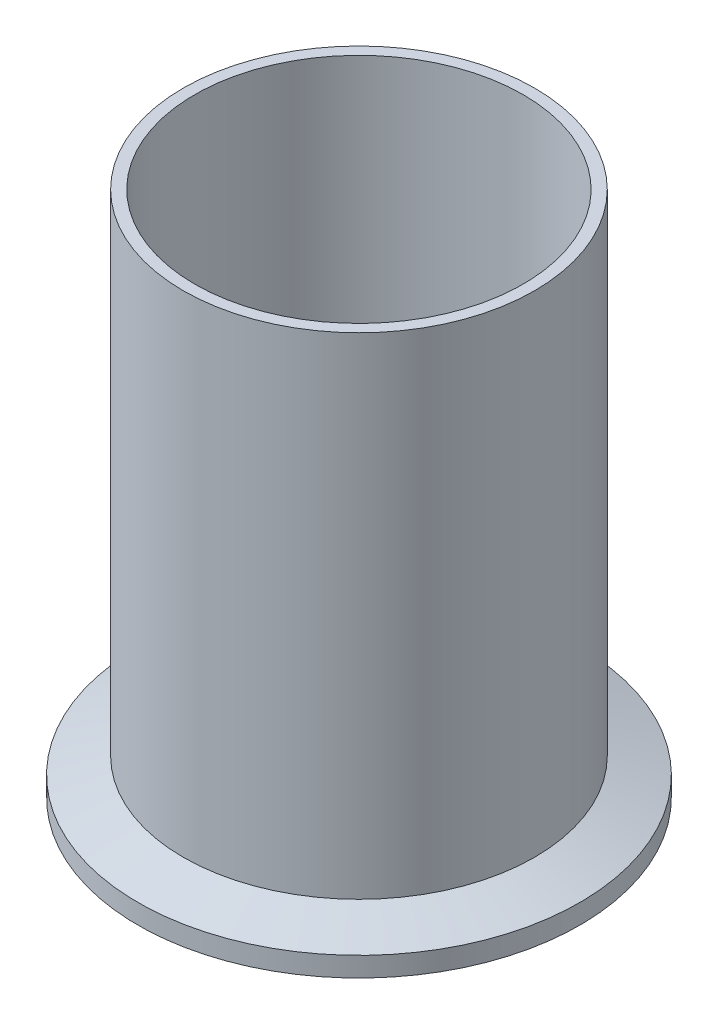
ISO-10303-21;
HEADER;
FILE_DESCRIPTION(('STEP AP214'),'2;1');
FILE_NAME('part.step','',(''),(''),'','','');
FILE_SCHEMA(('AUTOMOTIVE_DESIGN { 1 0 10303 214 1 1 1 1 }'));
ENDSEC;
DATA;
#1=APPLICATION_CONTEXT('core data for automotive mechanical design processes');
#2=APPLICATION_PROTOCOL_DEFINITION('international standard','automotive_design',2000,#1);
#3=PRODUCT_CONTEXT('',#1,'mechanical');
#4=PRODUCT('Part','Part','',(#3));
#5=PRODUCT_RELATED_PRODUCT_CATEGORY('part','',(#4));
#6=PRODUCT_DEFINITION_FORMATION('','',#4);
#7=PRODUCT_DEFINITION_CONTEXT('part definition',#1,'design');
#8=PRODUCT_DEFINITION('design','',#6,#7);
#9=PRODUCT_DEFINITION_SHAPE('','',#8);
#10=(LENGTH_UNIT() NAMED_UNIT(*) SI_UNIT(.MILLI.,.METRE.));
#11=(NAMED_UNIT(*) PLANE_ANGLE_UNIT() SI_UNIT($,.RADIAN.));
#12=(NAMED_UNIT(*) SI_UNIT($,.STERADIAN.) SOLID_ANGLE_UNIT());
#13=UNCERTAINTY_MEASURE_WITH_UNIT(LENGTH_MEASURE(1.E-05),#10,'distance_accuracy_value','');
#14=(GEOMETRIC_REPRESENTATION_CONTEXT(3) GLOBAL_UNCERTAINTY_ASSIGNED_CONTEXT((#13)) GLOBAL_UNIT_ASSIGNED_CONTEXT((#10,
#11,#12)) REPRESENTATION_CONTEXT('',''));
#15=CARTESIAN_POINT('',(0.,0.,0.));
#16=DIRECTION('',(0.,0.,1.));
#17=DIRECTION('',(1.,0.,0.));
#18=AXIS2_PLACEMENT_3D('',#15,#16,#17);
#19=CARTESIAN_POINT('',(0.,0.7874,0.));
#20=DIRECTION('',(0.,-1.,0.));
#21=DIRECTION('',(0.,0.,-1.));
#22=AXIS2_PLACEMENT_3D('',#19,#20,#21);
#23=TOROIDAL_SURFACE('',#22,29.9866084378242,0.787399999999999);
#24=CARTESIAN_POINT('',(0.,0.,0.));
#25=DIRECTION('',(0.,-1.,0.));
#26=DIRECTION('',(0.,0.,-1.));
#27=AXIS2_PLACEMENT_3D('',#24,#25,#26);
#28=CIRCLE('',#27,29.9866084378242);
#29=CARTESIAN_POINT('',(0.,0.,-29.9866084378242));
#30=VERTEX_POINT('',#29);
#31=EDGE_CURVE('E67',#30,#30,#28,.T.);
#32=ORIENTED_EDGE('',*,*,#31,.T.);
#33=EDGE_LOOP('',(#32));
#34=FACE_BOUND('',#33,.T.);
#35=CARTESIAN_POINT('',(0.,0.474458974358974,0.));
#36=DIRECTION('',(0.,-1.,0.));
#37=DIRECTION('',(0.,0.,-1.));
#38=AXIS2_PLACEMENT_3D('',#35,#36,#37);
#39=CIRCLE('',#38,29.2640666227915);
#40=CARTESIAN_POINT('',(0.,0.474458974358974,-29.2640666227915));
#41=VERTEX_POINT('',#40);
#42=EDGE_CURVE('E10',#41,#41,#39,.T.);
#43=ORIENTED_EDGE('',*,*,#42,.F.);
#44=EDGE_LOOP('',(#43));
#45=FACE_BOUND('',#44,.T.);
#46=ADVANCED_FACE('F33',(#34,#45),#23,.T.);
#47=CARTESIAN_POINT('',(0.,0.,0.));
#48=DIRECTION('',(0.,-1.,0.));
#49=DIRECTION('',(0.,0.,-1.));
#50=AXIS2_PLACEMENT_3D('',#47,#48,#49);
#51=TOROIDAL_SURFACE('',#50,28.1686,1.1938);
#52=CARTESIAN_POINT('',(0.,0.474458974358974,0.));
#53=DIRECTION('',(0.,-1.,0.));
#54=DIRECTION('',(0.,0.,-1.));
#55=AXIS2_PLACEMENT_3D('',#52,#53,#54);
#56=CIRCLE('',#55,27.0731333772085);
#57=CARTESIAN_POINT('',(0.,0.474458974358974,-27.0731333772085));
#58=VERTEX_POINT('',#57);
#59=EDGE_CURVE('E39',#58,#58,#56,.T.);
#60=ORIENTED_EDGE('',*,*,#59,.F.);
#61=EDGE_LOOP('',(#60));
#62=FACE_BOUND('',#61,.T.);
#63=ORIENTED_EDGE('',*,*,#42,.T.);
#64=EDGE_LOOP('',(#63));
#65=FACE_BOUND('',#64,.T.);
#66=ADVANCED_FACE('F115',(#62,#65),#51,.F.);
#67=CARTESIAN_POINT('',(0.,0.7874,0.));
#68=DIRECTION('',(0.,-1.,0.));
#69=DIRECTION('',(0.,0.,-1.));
#70=AXIS2_PLACEMENT_3D('',#67,#68,#69);
#71=TOROIDAL_SURFACE('',#70,26.3505915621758,0.787399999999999);
#72=ORIENTED_EDGE('',*,*,#59,.T.);
#73=EDGE_LOOP('',(#72));
#74=FACE_BOUND('',#73,.T.);
#75=CARTESIAN_POINT('',(0.,0.,0.));
#76=DIRECTION('',(0.,-1.,0.));
#77=DIRECTION('',(0.,0.,-1.));
#78=AXIS2_PLACEMENT_3D('',#75,#76,#77);
#79=CIRCLE('',#78,26.3505915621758);
#80=CARTESIAN_POINT('',(0.,0.,-26.3505915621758));
#81=VERTEX_POINT('',#80);
#82=EDGE_CURVE('E43',#81,#81,#79,.T.);
#83=ORIENTED_EDGE('',*,*,#82,.F.);
#84=EDGE_LOOP('',(#83));
#85=FACE_BOUND('',#84,.T.);
#86=ADVANCED_FACE('F111',(#74,#85),#71,.T.);
#87=CARTESIAN_POINT('',(0.,0.,0.));
#88=DIRECTION('',(0.,1.,0.));
#89=DIRECTION('',(0.,0.,1.));
#90=AXIS2_PLACEMENT_3D('',#87,#88,#89);
#91=PLANE('',#90);
#92=CARTESIAN_POINT('',(0.,0.,0.));
#93=DIRECTION('',(0.,-1.,0.));
#94=DIRECTION('',(0.,0.,-1.));
#95=AXIS2_PLACEMENT_3D('',#92,#93,#94);
#96=CIRCLE('',#95,23.749);
#97=CARTESIAN_POINT('',(0.,0.,-23.749));
#98=VERTEX_POINT('',#97);
#99=EDGE_CURVE('E47',#98,#98,#96,.T.);
#100=ORIENTED_EDGE('',*,*,#99,.F.);
#101=EDGE_LOOP('',(#100));
#102=FACE_BOUND('',#101,.T.);
#103=ORIENTED_EDGE('',*,*,#82,.T.);
#104=EDGE_LOOP('',(#103));
#105=FACE_BOUND('',#104,.T.);
#106=ADVANCED_FACE('F105',(#102,#105),#91,.F.);
#107=CARTESIAN_POINT('',(0.,0.,0.));
#108=DIRECTION('',(0.,-1.,0.));
#109=DIRECTION('',(0.,0.,-1.));
#110=AXIS2_PLACEMENT_3D('',#107,#108,#109);
#111=CYLINDRICAL_SURFACE('',#110,23.749);
#112=ORIENTED_EDGE('',*,*,#99,.T.);
#113=EDGE_LOOP('',(#112));
#114=FACE_BOUND('',#113,.T.);
#115=CARTESIAN_POINT('',(0.,76.2,0.));
#116=DIRECTION('',(0.,-1.,0.));
#117=DIRECTION('',(0.,0.,-1.));
#118=AXIS2_PLACEMENT_3D('',#115,#116,#117);
#119=CIRCLE('',#118,23.749);
#120=CARTESIAN_POINT('',(0.,76.2,-23.749));
#121=VERTEX_POINT('',#120);
#122=EDGE_CURVE('E52',#121,#121,#119,.T.);
#123=ORIENTED_EDGE('',*,*,#122,.F.);
#124=EDGE_LOOP('',(#123));
#125=FACE_BOUND('',#124,.T.);
#126=ADVANCED_FACE('F100',(#114,#125),#111,.F.);
#127=CARTESIAN_POINT('',(0.,76.2,0.));
#128=DIRECTION('',(0.,-1.,0.));
#129=DIRECTION('',(0.,0.,-1.));
#130=AXIS2_PLACEMENT_3D('',#127,#128,#129);
#131=PLANE('',#130);
#132=CARTESIAN_POINT('',(0.,76.2,0.));
#133=DIRECTION('',(0.,-1.,0.));
#134=DIRECTION('',(0.,0.,-1.));
#135=AXIS2_PLACEMENT_3D('',#132,#133,#134);
#136=CIRCLE('',#135,25.4);
#137=CARTESIAN_POINT('',(0.,76.2,-25.4));
#138=VERTEX_POINT('',#137);
#139=EDGE_CURVE('E55',#138,#138,#136,.T.);
#140=ORIENTED_EDGE('',*,*,#139,.F.);
#141=EDGE_LOOP('',(#140));
#142=FACE_BOUND('',#141,.T.);
#143=ORIENTED_EDGE('',*,*,#122,.T.);
#144=EDGE_LOOP('',(#143));
#145=FACE_BOUND('',#144,.T.);
#146=ADVANCED_FACE('F94',(#142,#145),#131,.F.);
#147=CARTESIAN_POINT('',(0.,0.,0.));
#148=DIRECTION('',(0.,-1.,0.));
#149=DIRECTION('',(0.,0.,-1.));
#150=AXIS2_PLACEMENT_3D('',#147,#148,#149);
#151=CYLINDRICAL_SURFACE('',#150,25.4);
#152=CARTESIAN_POINT('',(0.,5.22996973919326,0.));
#153=DIRECTION('',(0.,-1.,0.));
#154=DIRECTION('',(0.,0.,-1.));
#155=AXIS2_PLACEMENT_3D('',#152,#153,#154);
#156=CIRCLE('',#155,25.4);
#157=CARTESIAN_POINT('',(0.,5.22996973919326,-25.4));
#158=VERTEX_POINT('',#157);
#159=EDGE_CURVE('E58',#158,#158,#156,.T.);
#160=ORIENTED_EDGE('',*,*,#159,.F.);
#161=EDGE_LOOP('',(#160));
#162=FACE_BOUND('',#161,.T.);
#163=ORIENTED_EDGE('',*,*,#139,.T.);
#164=EDGE_LOOP('',(#163));
#165=FACE_BOUND('',#164,.T.);
#166=ADVANCED_FACE('F88',(#162,#165),#151,.T.);
#167=CARTESIAN_POINT('',(0.,5.22996973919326,0.));
#168=DIRECTION('',(0.,-1.,0.));
#169=DIRECTION('',(0.,0.,-1.));
#170=AXIS2_PLACEMENT_3D('',#167,#168,#169);
#171=CONICAL_SURFACE('',#170,25.4,1.22173047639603);
#172=CARTESIAN_POINT('',(0.,2.8448,0.));
#173=DIRECTION('',(0.,-1.,0.));
#174=DIRECTION('',(0.,0.,-1.));
#175=AXIS2_PLACEMENT_3D('',#172,#173,#174);
#176=CIRCLE('',#175,31.9532);
#177=CARTESIAN_POINT('',(0.,2.8448,-31.9532));
#178=VERTEX_POINT('',#177);
#179=EDGE_CURVE('E61',#178,#178,#176,.T.);
#180=ORIENTED_EDGE('',*,*,#179,.F.);
#181=EDGE_LOOP('',(#180));
#182=FACE_BOUND('',#181,.T.);
#183=ORIENTED_EDGE('',*,*,#159,.T.);
#184=EDGE_LOOP('',(#183));
#185=FACE_BOUND('',#184,.T.);
#186=ADVANCED_FACE('F82',(#182,#185),#171,.T.);
#187=CARTESIAN_POINT('',(0.,0.,0.));
#188=DIRECTION('',(0.,-1.,0.));
#189=DIRECTION('',(0.,0.,-1.));
#190=AXIS2_PLACEMENT_3D('',#187,#188,#189);
#191=CYLINDRICAL_SURFACE('',#190,31.9532);
#192=CARTESIAN_POINT('',(0.,0.,0.));
#193=DIRECTION('',(0.,-1.,0.));
#194=DIRECTION('',(0.,0.,-1.));
#195=AXIS2_PLACEMENT_3D('',#192,#193,#194);
#196=CIRCLE('',#195,31.9532);
#197=CARTESIAN_POINT('',(0.,0.,-31.9532));
#198=VERTEX_POINT('',#197);
#199=EDGE_CURVE('E64',#198,#198,#196,.T.);
#200=ORIENTED_EDGE('',*,*,#199,.F.);
#201=EDGE_LOOP('',(#200));
#202=FACE_BOUND('',#201,.T.);
#203=ORIENTED_EDGE('',*,*,#179,.T.);
#204=EDGE_LOOP('',(#203));
#205=FACE_BOUND('',#204,.T.);
#206=ADVANCED_FACE('F76',(#202,#205),#191,.T.);
#207=CARTESIAN_POINT('',(0.,0.,0.));
#208=DIRECTION('',(0.,1.,0.));
#209=DIRECTION('',(0.,0.,1.));
#210=AXIS2_PLACEMENT_3D('',#207,#208,#209);
#211=PLANE('',#210);
#212=ORIENTED_EDGE('',*,*,#31,.F.);
#213=EDGE_LOOP('',(#212));
#214=FACE_BOUND('',#213,.T.);
#215=ORIENTED_EDGE('',*,*,#199,.T.);
#216=EDGE_LOOP('',(#215));
#217=FACE_BOUND('',#216,.T.);
#218=ADVANCED_FACE('F73',(#214,#217),#211,.F.);
#219=CLOSED_SHELL('',(#46,#66,#86,#106,#126,#146,#166,#186,#206,#218));
#220=MANIFOLD_SOLID_BREP('B2',#219);
#221=ADVANCED_BREP_SHAPE_REPRESENTATION('',(#18,#220),#14);
#222=SHAPE_DEFINITION_REPRESENTATION(#9,#221);
ENDSEC;
END-ISO-10303-21;
